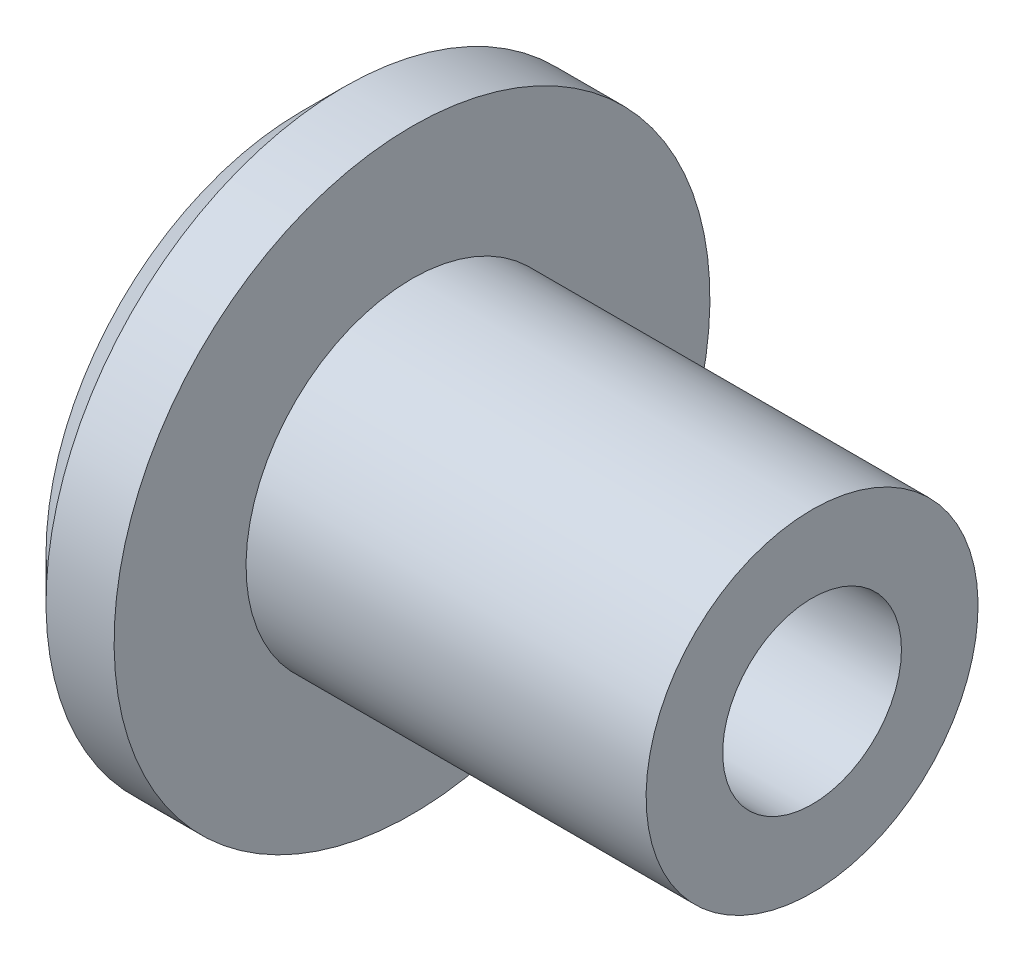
ISO-10303-21;
HEADER;
FILE_DESCRIPTION(('STEP AP214'),'2;1');
FILE_NAME('part.step','',(''),(''),'','','');
FILE_SCHEMA(('AUTOMOTIVE_DESIGN { 1 0 10303 214 1 1 1 1 }'));
ENDSEC;
DATA;
#1=APPLICATION_CONTEXT('core data for automotive mechanical design processes');
#2=APPLICATION_PROTOCOL_DEFINITION('international standard','automotive_design',2000,#1);
#3=PRODUCT_CONTEXT('',#1,'mechanical');
#4=PRODUCT('Part','Part','',(#3));
#5=PRODUCT_RELATED_PRODUCT_CATEGORY('part','',(#4));
#6=PRODUCT_DEFINITION_FORMATION('','',#4);
#7=PRODUCT_DEFINITION_CONTEXT('part definition',#1,'design');
#8=PRODUCT_DEFINITION('design','',#6,#7);
#9=PRODUCT_DEFINITION_SHAPE('','',#8);
#10=(LENGTH_UNIT() NAMED_UNIT(*) SI_UNIT(.MILLI.,.METRE.));
#11=(NAMED_UNIT(*) PLANE_ANGLE_UNIT() SI_UNIT($,.RADIAN.));
#12=(NAMED_UNIT(*) SI_UNIT($,.STERADIAN.) SOLID_ANGLE_UNIT());
#13=UNCERTAINTY_MEASURE_WITH_UNIT(LENGTH_MEASURE(1.E-05),#10,'distance_accuracy_value','');
#14=(GEOMETRIC_REPRESENTATION_CONTEXT(3) GLOBAL_UNCERTAINTY_ASSIGNED_CONTEXT((#13)) GLOBAL_UNIT_ASSIGNED_CONTEXT((#10,
#11,#12)) REPRESENTATION_CONTEXT('',''));
#15=CARTESIAN_POINT('',(0.,0.,0.));
#16=DIRECTION('',(0.,0.,1.));
#17=DIRECTION('',(1.,0.,0.));
#18=AXIS2_PLACEMENT_3D('',#15,#16,#17);
#19=CARTESIAN_POINT('',(0.,0.,0.));
#20=DIRECTION('',(-1.,0.,0.));
#21=DIRECTION('',(0.,-1.,0.));
#22=AXIS2_PLACEMENT_3D('',#19,#20,#21);
#23=PLANE('',#22);
#24=CARTESIAN_POINT('',(0.,0.,0.));
#25=DIRECTION('',(1.,0.,0.));
#26=DIRECTION('',(0.,0.,-1.));
#27=AXIS2_PLACEMENT_3D('',#24,#25,#26);
#28=CIRCLE('',#27,2.1);
#29=CARTESIAN_POINT('',(0.,0.,-2.1));
#30=VERTEX_POINT('',#29);
#31=EDGE_CURVE('E51',#30,#30,#28,.T.);
#32=ORIENTED_EDGE('',*,*,#31,.T.);
#33=EDGE_LOOP('',(#32));
#34=FACE_BOUND('',#33,.T.);
#35=CARTESIAN_POINT('',(0.,0.,0.));
#36=DIRECTION('',(1.,0.,0.));
#37=DIRECTION('',(0.,1.,0.));
#38=AXIS2_PLACEMENT_3D('',#35,#36,#37);
#39=CIRCLE('',#38,5.99999999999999);
#40=CARTESIAN_POINT('',(0.,5.99999999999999,0.));
#41=VERTEX_POINT('',#40);
#42=EDGE_CURVE('E10',#41,#41,#39,.T.);
#43=ORIENTED_EDGE('',*,*,#42,.F.);
#44=EDGE_LOOP('',(#43));
#45=FACE_BOUND('',#44,.T.);
#46=ADVANCED_FACE('F29',(#34,#45),#23,.T.);
#47=CARTESIAN_POINT('',(0.999999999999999,0.,0.));
#48=DIRECTION('',(1.,0.,0.));
#49=DIRECTION('',(0.,1.,0.));
#50=AXIS2_PLACEMENT_3D('',#47,#48,#49);
#51=CONICAL_SURFACE('',#50,6.99999999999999,0.785398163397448);
#52=ORIENTED_EDGE('',*,*,#42,.T.);
#53=EDGE_LOOP('',(#52));
#54=FACE_BOUND('',#53,.T.);
#55=CARTESIAN_POINT('',(0.999999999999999,0.,0.));
#56=DIRECTION('',(1.,0.,0.));
#57=DIRECTION('',(0.,1.,0.));
#58=AXIS2_PLACEMENT_3D('',#55,#56,#57);
#59=CIRCLE('',#58,6.99999999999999);
#60=CARTESIAN_POINT('',(1.,6.99999999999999,0.));
#61=VERTEX_POINT('',#60);
#62=EDGE_CURVE('E35',#61,#61,#59,.T.);
#63=ORIENTED_EDGE('',*,*,#62,.F.);
#64=EDGE_LOOP('',(#63));
#65=FACE_BOUND('',#64,.T.);
#66=ADVANCED_FACE('F78',(#54,#65),#51,.T.);
#67=CARTESIAN_POINT('',(12.,0.,0.));
#68=DIRECTION('',(1.,0.,0.));
#69=DIRECTION('',(0.,1.,0.));
#70=AXIS2_PLACEMENT_3D('',#67,#68,#69);
#71=CYLINDRICAL_SURFACE('',#70,7.);
#72=ORIENTED_EDGE('',*,*,#62,.T.);
#73=EDGE_LOOP('',(#72));
#74=FACE_BOUND('',#73,.T.);
#75=CARTESIAN_POINT('',(2.6,0.,0.));
#76=DIRECTION('',(1.,0.,0.));
#77=DIRECTION('',(0.,1.,0.));
#78=AXIS2_PLACEMENT_3D('',#75,#76,#77);
#79=CIRCLE('',#78,7.);
#80=CARTESIAN_POINT('',(2.6,7.,0.));
#81=VERTEX_POINT('',#80);
#82=EDGE_CURVE('E39',#81,#81,#79,.T.);
#83=ORIENTED_EDGE('',*,*,#82,.F.);
#84=EDGE_LOOP('',(#83));
#85=FACE_BOUND('',#84,.T.);
#86=ADVANCED_FACE('F74',(#74,#85),#71,.T.);
#87=CARTESIAN_POINT('',(2.6,7.,0.));
#88=DIRECTION('',(1.,0.,0.));
#89=DIRECTION('',(0.,1.,0.));
#90=AXIS2_PLACEMENT_3D('',#87,#88,#89);
#91=PLANE('',#90);
#92=ORIENTED_EDGE('',*,*,#82,.T.);
#93=EDGE_LOOP('',(#92));
#94=FACE_BOUND('',#93,.T.);
#95=CARTESIAN_POINT('',(2.6,0.,0.));
#96=DIRECTION('',(1.,0.,0.));
#97=DIRECTION('',(0.,1.,0.));
#98=AXIS2_PLACEMENT_3D('',#95,#96,#97);
#99=CIRCLE('',#98,3.9);
#100=CARTESIAN_POINT('',(2.6,3.9,0.));
#101=VERTEX_POINT('',#100);
#102=EDGE_CURVE('E43',#101,#101,#99,.T.);
#103=ORIENTED_EDGE('',*,*,#102,.F.);
#104=EDGE_LOOP('',(#103));
#105=FACE_BOUND('',#104,.T.);
#106=ADVANCED_FACE('F68',(#94,#105),#91,.T.);
#107=CARTESIAN_POINT('',(12.,0.,0.));
#108=DIRECTION('',(1.,0.,0.));
#109=DIRECTION('',(0.,1.,0.));
#110=AXIS2_PLACEMENT_3D('',#107,#108,#109);
#111=CYLINDRICAL_SURFACE('',#110,3.9);
#112=ORIENTED_EDGE('',*,*,#102,.T.);
#113=EDGE_LOOP('',(#112));
#114=FACE_BOUND('',#113,.T.);
#115=CARTESIAN_POINT('',(12.,0.,0.));
#116=DIRECTION('',(1.,0.,0.));
#117=DIRECTION('',(0.,1.,0.));
#118=AXIS2_PLACEMENT_3D('',#115,#116,#117);
#119=CIRCLE('',#118,3.9);
#120=CARTESIAN_POINT('',(12.,3.9,0.));
#121=VERTEX_POINT('',#120);
#122=EDGE_CURVE('E48',#121,#121,#119,.T.);
#123=ORIENTED_EDGE('',*,*,#122,.F.);
#124=EDGE_LOOP('',(#123));
#125=FACE_BOUND('',#124,.T.);
#126=ADVANCED_FACE('F63',(#114,#125),#111,.T.);
#127=CARTESIAN_POINT('',(12.,3.9,0.));
#128=DIRECTION('',(1.,0.,0.));
#129=DIRECTION('',(0.,1.,0.));
#130=AXIS2_PLACEMENT_3D('',#127,#128,#129);
#131=PLANE('',#130);
#132=CARTESIAN_POINT('',(12.,0.,0.));
#133=DIRECTION('',(1.,0.,0.));
#134=DIRECTION('',(0.,0.,-1.));
#135=AXIS2_PLACEMENT_3D('',#132,#133,#134);
#136=CIRCLE('',#135,2.09999999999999);
#137=CARTESIAN_POINT('',(12.,0.,-2.09999999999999));
#138=VERTEX_POINT('',#137);
#139=EDGE_CURVE('E54',#138,#138,#136,.T.);
#140=ORIENTED_EDGE('',*,*,#139,.F.);
#141=EDGE_LOOP('',(#140));
#142=FACE_BOUND('',#141,.T.);
#143=ORIENTED_EDGE('',*,*,#122,.T.);
#144=EDGE_LOOP('',(#143));
#145=FACE_BOUND('',#144,.T.);
#146=ADVANCED_FACE('F60',(#142,#145),#131,.T.);
#147=CARTESIAN_POINT('',(12.,0.,0.));
#148=DIRECTION('',(1.,0.,0.));
#149=DIRECTION('',(0.,0.,-1.));
#150=AXIS2_PLACEMENT_3D('',#147,#148,#149);
#151=CYLINDRICAL_SURFACE('',#150,2.09999999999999);
#152=ORIENTED_EDGE('',*,*,#31,.F.);
#153=EDGE_LOOP('',(#152));
#154=FACE_BOUND('',#153,.T.);
#155=ORIENTED_EDGE('',*,*,#139,.T.);
#156=EDGE_LOOP('',(#155));
#157=FACE_BOUND('',#156,.T.);
#158=ADVANCED_FACE('F58',(#154,#157),#151,.F.);
#159=CLOSED_SHELL('',(#46,#66,#86,#106,#126,#146,#158));
#160=MANIFOLD_SOLID_BREP('B2',#159);
#161=ADVANCED_BREP_SHAPE_REPRESENTATION('',(#18,#160),#14);
#162=SHAPE_DEFINITION_REPRESENTATION(#9,#161);
ENDSEC;
END-ISO-10303-21;
